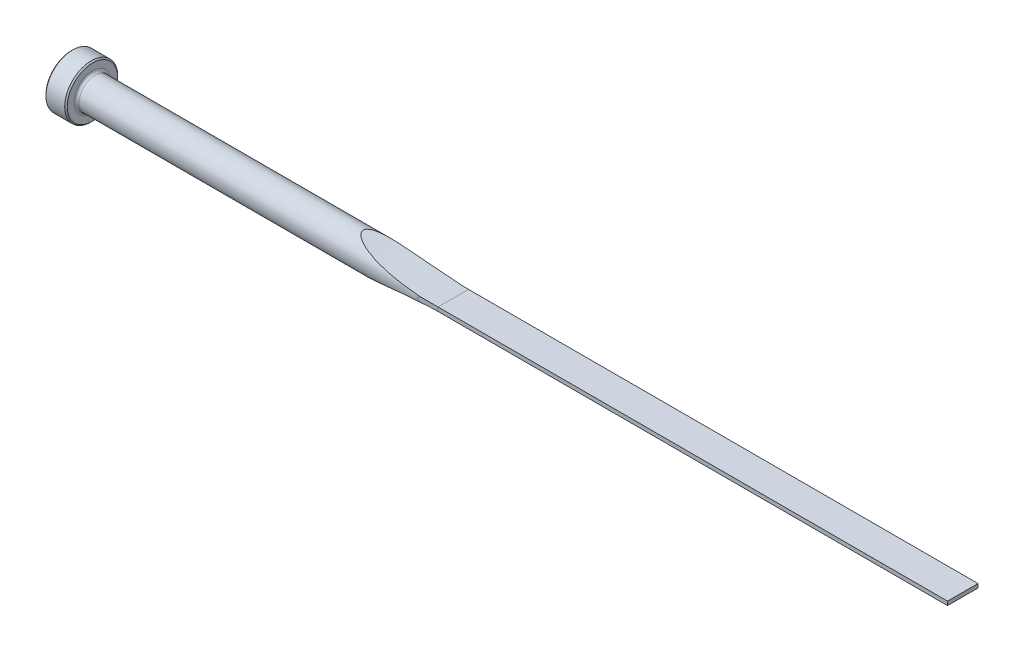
ISO-10303-21;
HEADER;
FILE_DESCRIPTION(('STEP AP214'),'2;1');
FILE_NAME('part.step','',(''),(''),'','','');
FILE_SCHEMA(('AUTOMOTIVE_DESIGN { 1 0 10303 214 1 1 1 1 }'));
ENDSEC;
DATA;
#1=APPLICATION_CONTEXT('core data for automotive mechanical design processes');
#2=APPLICATION_PROTOCOL_DEFINITION('international standard','automotive_design',2000,#1);
#3=PRODUCT_CONTEXT('',#1,'mechanical');
#4=PRODUCT('Part','Part','',(#3));
#5=PRODUCT_RELATED_PRODUCT_CATEGORY('part','',(#4));
#6=PRODUCT_DEFINITION_FORMATION('','',#4);
#7=PRODUCT_DEFINITION_CONTEXT('part definition',#1,'design');
#8=PRODUCT_DEFINITION('design','',#6,#7);
#9=PRODUCT_DEFINITION_SHAPE('','',#8);
#10=(LENGTH_UNIT() NAMED_UNIT(*) SI_UNIT(.MILLI.,.METRE.));
#11=(NAMED_UNIT(*) PLANE_ANGLE_UNIT() SI_UNIT($,.RADIAN.));
#12=(NAMED_UNIT(*) SI_UNIT($,.STERADIAN.) SOLID_ANGLE_UNIT());
#13=UNCERTAINTY_MEASURE_WITH_UNIT(LENGTH_MEASURE(1.E-05),#10,'distance_accuracy_value','');
#14=(GEOMETRIC_REPRESENTATION_CONTEXT(3) GLOBAL_UNCERTAINTY_ASSIGNED_CONTEXT((#13)) GLOBAL_UNIT_ASSIGNED_CONTEXT((#10,
#11,#12)) REPRESENTATION_CONTEXT('',''));
#15=CARTESIAN_POINT('',(0.,0.,0.));
#16=DIRECTION('',(0.,0.,1.));
#17=DIRECTION('',(1.,0.,0.));
#18=AXIS2_PLACEMENT_3D('',#15,#16,#17);
#19=CARTESIAN_POINT('',(0.,0.,0.));
#20=DIRECTION('',(-1.,0.,0.));
#21=DIRECTION('',(0.,0.,1.));
#22=AXIS2_PLACEMENT_3D('',#19,#20,#21);
#23=CYLINDRICAL_SURFACE('',#22,4.7625);
#24=CARTESIAN_POINT('',(7.112,0.,0.));
#25=DIRECTION('',(-1.,0.,0.));
#26=DIRECTION('',(0.,0.,1.));
#27=AXIS2_PLACEMENT_3D('',#24,#25,#26);
#28=CIRCLE('',#27,4.7625);
#29=CARTESIAN_POINT('',(7.112,0.,4.7625));
#30=VERTEX_POINT('',#29);
#31=EDGE_CURVE('E153',#30,#30,#28,.F.);
#32=ORIENTED_EDGE('',*,*,#31,.T.);
#33=EDGE_LOOP('',(#32));
#34=FACE_BOUND('',#33,.T.);
#35=CARTESIAN_POINT('',(114.3,1.37629566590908,4.55929999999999));
#36=CARTESIAN_POINT('',(114.100243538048,1.37627017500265,4.55929946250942));
#37=CARTESIAN_POINT('',(113.900483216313,1.37406392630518,4.55997325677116));
#38=CARTESIAN_POINT('',(113.501024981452,1.36511039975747,4.56266611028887));
#39=CARTESIAN_POINT('',(113.301327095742,1.35836200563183,4.56468550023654));
#40=CARTESIAN_POINT('',(112.900347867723,1.34006170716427,4.57009060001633));
#41=CARTESIAN_POINT('',(112.699068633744,1.32846669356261,4.57348856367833));
#42=CARTESIAN_POINT('',(112.296928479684,1.30007175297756,4.58164172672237));
#43=CARTESIAN_POINT('',(112.096067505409,1.28327254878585,4.58639673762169));
#44=CARTESIAN_POINT('',(111.696176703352,1.24395343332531,4.59721659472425));
#45=CARTESIAN_POINT('',(111.497143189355,1.22146913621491,4.60327325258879));
#46=CARTESIAN_POINT('',(111.099904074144,1.16973426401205,4.6166926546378));
#47=CARTESIAN_POINT('',(110.90169881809,1.1404811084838,4.62405589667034));
#48=CARTESIAN_POINT('',(110.507485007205,1.07370926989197,4.640013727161));
#49=CARTESIAN_POINT('',(110.311471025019,1.03622172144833,4.64860363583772));
#50=CARTESIAN_POINT('',(109.921964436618,0.950234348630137,4.66695416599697));
#51=CARTESIAN_POINT('',(109.728469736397,0.901744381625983,4.67671373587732));
#52=CARTESIAN_POINT('',(109.489568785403,0.830609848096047,4.68952997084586));
#53=CARTESIAN_POINT('',(109.441796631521,0.815810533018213,4.69213189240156));
#54=CARTESIAN_POINT('',(109.346645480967,0.784967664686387,4.69739068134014));
#55=CARTESIAN_POINT('',(109.29926657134,0.768923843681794,4.70004756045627));
#56=CARTESIAN_POINT('',(109.157175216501,0.71840494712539,4.70812874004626));
#57=CARTESIAN_POINT('',(109.063234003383,0.681752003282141,4.71362458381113));
#58=CARTESIAN_POINT('',(108.877534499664,0.599731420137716,4.72477713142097));
#59=CARTESIAN_POINT('',(108.785820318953,0.554256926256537,4.73043499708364));
#60=CARTESIAN_POINT('',(108.654614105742,0.476034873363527,4.73871868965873));
#61=CARTESIAN_POINT('',(108.612099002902,0.448424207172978,4.7414354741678));
#62=CARTESIAN_POINT('',(108.530424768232,0.388667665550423,4.74670987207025));
#63=CARTESIAN_POINT('',(108.491254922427,0.35653721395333,4.74926798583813));
#64=CARTESIAN_POINT('',(108.434384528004,0.301094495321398,4.75301502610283));
#65=CARTESIAN_POINT('',(108.414664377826,0.279884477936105,4.75432176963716));
#66=CARTESIAN_POINT('',(108.378171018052,0.235020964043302,4.75675058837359));
#67=CARTESIAN_POINT('',(108.361393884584,0.211370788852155,4.75787290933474));
#68=CARTESIAN_POINT('',(108.336135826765,0.16808537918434,4.75956809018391));
#69=CARTESIAN_POINT('',(108.326635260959,0.149056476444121,4.76020769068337));
#70=CARTESIAN_POINT('',(108.31078402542,0.109713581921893,4.76127659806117));
#71=CARTESIAN_POINT('',(108.304429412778,0.0894012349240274,4.76170616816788));
#72=CARTESIAN_POINT('',(108.295545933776,0.0476995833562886,4.76230708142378));
#73=CARTESIAN_POINT('',(108.293058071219,0.0263011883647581,4.76247565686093));
#74=CARTESIAN_POINT('',(108.292412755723,-0.0165581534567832,4.76251936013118));
#75=CARTESIAN_POINT('',(108.294253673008,-0.0380190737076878,4.76239459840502));
#76=CARTESIAN_POINT('',(108.30142234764,-0.0771509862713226,4.76190953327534));
#77=CARTESIAN_POINT('',(108.306214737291,-0.0949256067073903,4.76158540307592));
#78=CARTESIAN_POINT('',(108.318318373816,-0.129583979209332,4.76076832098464));
#79=CARTESIAN_POINT('',(108.325631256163,-0.146467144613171,4.76027525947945));
#80=CARTESIAN_POINT('',(108.347823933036,-0.190109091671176,4.75878258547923));
#81=CARTESIAN_POINT('',(108.364497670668,-0.21594512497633,4.75766444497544));
#82=CARTESIAN_POINT('',(108.401515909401,-0.264813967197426,4.75519504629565));
#83=CARTESIAN_POINT('',(108.421871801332,-0.287837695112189,4.75384306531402));
#84=CARTESIAN_POINT('',(108.486246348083,-0.353109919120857,4.74959319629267));
#85=CARTESIAN_POINT('',(108.5337556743,-0.391849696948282,4.74648889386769));
#86=CARTESIAN_POINT('',(108.633252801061,-0.462955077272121,4.74007706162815));
#87=CARTESIAN_POINT('',(108.685255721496,-0.495297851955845,4.73676885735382));
#88=CARTESIAN_POINT('',(108.832460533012,-0.57848482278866,4.72754240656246));
#89=CARTESIAN_POINT('',(108.930312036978,-0.624585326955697,4.72156110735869));
#90=CARTESIAN_POINT('',(109.129656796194,-0.708279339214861,4.70972175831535));
#91=CARTESIAN_POINT('',(109.231158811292,-0.745850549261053,4.70386406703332));
#92=CARTESIAN_POINT('',(109.437175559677,-0.815246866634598,4.69233729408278));
#93=CARTESIAN_POINT('',(109.54170965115,-0.847014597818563,4.68667050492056));
#94=CARTESIAN_POINT('',(109.751931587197,-0.905852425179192,4.67565197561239));
#95=CARTESIAN_POINT('',(109.857617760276,-0.93292855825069,4.67029983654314));
#96=CARTESIAN_POINT('',(110.147207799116,-1.00180171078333,4.65615804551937));
#97=CARTESIAN_POINT('',(110.331993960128,-1.03994988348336,4.64770520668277));
#98=CARTESIAN_POINT('',(110.703115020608,-1.10820041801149,4.63190013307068));
#99=CARTESIAN_POINT('',(110.889450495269,-1.13829964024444,4.62454832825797));
#100=CARTESIAN_POINT('',(111.263496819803,-1.19209136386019,4.61097562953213));
#101=CARTESIAN_POINT('',(111.451209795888,-1.21576959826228,4.60475726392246));
#102=CARTESIAN_POINT('',(111.827286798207,-1.25764094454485,4.5934961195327));
#103=CARTESIAN_POINT('',(112.015650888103,-1.27583350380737,4.58845345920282));
#104=CARTESIAN_POINT('',(112.553477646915,-1.32086317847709,4.5757714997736));
#105=CARTESIAN_POINT('',(112.903477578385,-1.34186157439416,4.56957976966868));
#106=CARTESIAN_POINT('',(113.428033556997,-1.36263417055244,4.56340533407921));
#107=CARTESIAN_POINT('',(113.602391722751,-1.3677712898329,4.56186604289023));
#108=CARTESIAN_POINT('',(113.951163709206,-1.37459791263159,4.55981341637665));
#109=CARTESIAN_POINT('',(114.125577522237,-1.37628777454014,4.55929997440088));
#110=CARTESIAN_POINT('',(114.3,-1.37629566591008,4.55929999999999));
#111=B_SPLINE_CURVE_WITH_KNOTS('',3,(#35,#36,#37,#38,#39,#40,#41,#42,#43,#44,#45,#46,#47,#48,
#49,#50,#51,#52,#53,#54,#55,#56,#57,#58,#59,#60,#61,#62,#63,#64,#65,#66,#67,#68,#69,#70,#71,#72,
#73,#74,#75,#76,#77,#78,#79,#80,#81,#82,#83,#84,#85,#86,#87,#88,#89,#90,#91,#92,#93,#94,#95,#96,
#97,#98,#99,#100,#101,#102,#103,#104,#105,#106,#107,#108,#109,#110),.UNSPECIFIED.,.F.,.F.,(4,2,
2,2,2,2,2,2,2,2,2,2,2,2,2,2,2,2,2,2,2,2,2,2,2,2,2,2,2,2,2,2,2,2,2,2,2,4),(0.,0.599262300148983,
1.19867192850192,1.80353056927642,2.40830524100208,3.00938132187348,3.61068692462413,
4.20975694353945,4.80829234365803,4.95851786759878,5.10877580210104,5.41155733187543,
5.71826557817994,5.87039269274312,6.02201272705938,6.10881533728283,6.19550132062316,
6.2591195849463,6.32265791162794,6.38686552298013,6.45104896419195,6.50606849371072,
6.56112379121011,6.65289509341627,6.74495530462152,6.92807013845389,7.11182707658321,
7.43597686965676,7.76096456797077,8.08900931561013,8.41662876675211,8.98296372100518,
9.54951926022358,10.117323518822,10.6851849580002,11.7368092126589,12.26010406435,
12.7833445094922),.UNSPECIFIED.);
#112=CARTESIAN_POINT('',(109.193722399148,0.730969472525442,4.70606947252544));
#113=VERTEX_POINT('',#112);
#114=CARTESIAN_POINT('',(109.193722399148,-0.730969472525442,4.70606947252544));
#115=VERTEX_POINT('',#114);
#116=EDGE_CURVE('E156',#113,#115,#111,.T.);
#117=ORIENTED_EDGE('',*,*,#116,.F.);
#118=CARTESIAN_POINT('',(114.3,0.584199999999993,4.72653325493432));
#119=CARTESIAN_POINT('',(113.902944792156,0.584199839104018,4.72652364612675));
#120=CARTESIAN_POINT('',(113.505889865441,0.586860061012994,4.7262042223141));
#121=CARTESIAN_POINT('',(112.711851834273,0.597500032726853,4.72487593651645));
#122=CARTESIAN_POINT('',(112.314868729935,0.605479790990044,4.7238670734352));
#123=CARTESIAN_POINT('',(111.521014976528,0.626758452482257,4.72108998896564));
#124=CARTESIAN_POINT('',(111.124144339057,0.640057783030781,4.71932170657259));
#125=CARTESIAN_POINT('',(110.330625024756,0.671972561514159,4.71488209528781));
#126=CARTESIAN_POINT('',(109.933976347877,0.690588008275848,4.71221076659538));
#127=CARTESIAN_POINT('',(108.742109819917,0.754530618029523,4.70255315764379));
#128=CARTESIAN_POINT('',(107.947318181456,0.807891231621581,4.69392942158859));
#129=CARTESIAN_POINT('',(106.35960041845,0.935939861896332,4.67008030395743));
#130=CARTESIAN_POINT('',(105.56667420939,1.01062689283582,4.65485522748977));
#131=CARTESIAN_POINT('',(103.983027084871,1.1812867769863,4.61451041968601));
#132=CARTESIAN_POINT('',(103.192307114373,1.27726765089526,4.58938695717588));
#133=CARTESIAN_POINT('',(102.008766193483,1.4370868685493,4.5408421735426));
#134=CARTESIAN_POINT('',(101.614638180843,1.49300736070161,4.52284840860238));
#135=CARTESIAN_POINT('',(100.827389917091,1.61010184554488,4.48250212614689));
#136=CARTESIAN_POINT('',(100.434269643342,1.67127571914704,4.46014970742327));
#137=CARTESIAN_POINT('',(99.6495779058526,1.79877941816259,4.41026980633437));
#138=CARTESIAN_POINT('',(99.2580053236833,1.8651042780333,4.3827472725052));
#139=CARTESIAN_POINT('',(98.4762617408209,2.00290585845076,4.3215116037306));
#140=CARTESIAN_POINT('',(98.0860906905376,2.07438239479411,4.28779869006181));
#141=CARTESIAN_POINT('',(97.3075285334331,2.22239347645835,4.2129861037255));
#142=CARTESIAN_POINT('',(96.9191369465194,2.29892655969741,4.17188856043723));
#143=CARTESIAN_POINT('',(96.1444245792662,2.45695511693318,4.08082096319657));
#144=CARTESIAN_POINT('',(95.7581036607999,2.53845025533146,4.03085150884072));
#145=CARTESIAN_POINT('',(94.9874438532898,2.70637498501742,3.92008763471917));
#146=CARTESIAN_POINT('',(94.6031088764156,2.79281189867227,3.85927685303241));
#147=CARTESIAN_POINT('',(93.8377159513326,2.97027452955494,3.72442012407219));
#148=CARTESIAN_POINT('',(93.4566587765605,3.06130129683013,3.65037113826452));
#149=CARTESIAN_POINT('',(92.6987741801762,3.24761090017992,3.48568183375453));
#150=CARTESIAN_POINT('',(92.3219502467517,3.34289696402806,3.39502876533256));
#151=CARTESIAN_POINT('',(91.7618242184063,3.4883984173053,3.24304672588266));
#152=CARTESIAN_POINT('',(91.5760042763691,3.53731746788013,3.18973138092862));
#153=CARTESIAN_POINT('',(91.2064522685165,3.63587680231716,3.07691915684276));
#154=CARTESIAN_POINT('',(91.0227199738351,3.68551700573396,3.01742296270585));
#155=CARTESIAN_POINT('',(90.6569945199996,3.78557453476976,2.89091152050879));
#156=CARTESIAN_POINT('',(90.4750141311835,3.83599446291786,2.82386117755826));
#157=CARTESIAN_POINT('',(90.114453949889,3.93711113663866,2.68108699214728));
#158=CARTESIAN_POINT('',(89.9358753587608,3.98780797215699,2.60536014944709));
#159=CARTESIAN_POINT('',(89.5841209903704,4.08883317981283,2.44374796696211));
#160=CARTESIAN_POINT('',(89.4109269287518,4.13916221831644,2.35790320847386));
#161=CARTESIAN_POINT('',(89.0712961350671,4.23894369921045,2.17342840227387));
#162=CARTESIAN_POINT('',(88.9048532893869,4.28839691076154,2.07481027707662));
#163=CARTESIAN_POINT('',(88.6275154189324,4.3716378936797,1.89136325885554));
#164=CARTESIAN_POINT('',(88.5141792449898,4.40591470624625,1.81047425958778));
#165=CARTESIAN_POINT('',(88.2946283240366,4.47276665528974,1.63838676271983));
#166=CARTESIAN_POINT('',(88.1884253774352,4.50533895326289,1.54717182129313));
#167=CARTESIAN_POINT('',(87.9857286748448,4.5678854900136,1.35148733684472));
#168=CARTESIAN_POINT('',(87.8893444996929,4.59782997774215,1.24689256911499));
#169=CARTESIAN_POINT('',(87.7135348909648,4.65273004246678,1.02307765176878));
#170=CARTESIAN_POINT('',(87.6340566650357,4.6777011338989,0.903904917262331));
#171=CARTESIAN_POINT('',(87.5263611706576,4.71165622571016,0.69859144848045));
#172=CARTESIAN_POINT('',(87.4901398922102,4.72310998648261,0.617097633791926));
#173=CARTESIAN_POINT('',(87.4304074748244,4.74202643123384,0.449118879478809));
#174=CARTESIAN_POINT('',(87.4068809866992,4.74949393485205,0.362640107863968));
#175=CARTESIAN_POINT('',(87.3747493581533,4.75969832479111,0.185892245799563));
#176=CARTESIAN_POINT('',(87.3662630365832,4.7623975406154,0.0955986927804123));
#177=CARTESIAN_POINT('',(87.3656367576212,4.76259662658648,-0.085057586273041));
#178=CARTESIAN_POINT('',(87.3734964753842,4.76009660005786,-0.175420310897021));
#179=CARTESIAN_POINT('',(87.4031382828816,4.75068226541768,-0.344936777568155));
#180=CARTESIAN_POINT('',(87.4235784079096,4.74419351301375,-0.424358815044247));
#181=CARTESIAN_POINT('',(87.4753356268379,4.72779541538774,-0.579160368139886));
#182=CARTESIAN_POINT('',(87.5066584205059,4.71788427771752,-0.654537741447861));
#183=CARTESIAN_POINT('',(87.5996380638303,4.68853838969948,-0.844402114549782));
#184=CARTESIAN_POINT('',(87.6682094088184,4.66696066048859,-0.955150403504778));
#185=CARTESIAN_POINT('',(87.8207367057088,4.61921883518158,-1.16440044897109));
#186=CARTESIAN_POINT('',(87.9047403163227,4.59304054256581,-1.26286263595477));
#187=CARTESIAN_POINT('',(88.0765502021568,4.53981707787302,-1.44205709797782));
#188=CARTESIAN_POINT('',(88.1636312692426,4.51297467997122,-1.52355894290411));
#189=CARTESIAN_POINT('',(88.3442071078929,4.45764093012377,-1.67857793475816));
#190=CARTESIAN_POINT('',(88.4377077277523,4.42914807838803,-1.75208763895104));
#191=CARTESIAN_POINT('',(88.6295566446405,4.37104937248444,-1.89238074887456));
#192=CARTESIAN_POINT('',(88.7279143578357,4.34144138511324,-1.95915025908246));
#193=CARTESIAN_POINT('',(88.9281237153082,4.28156612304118,-2.08675712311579));
#194=CARTESIAN_POINT('',(89.0299740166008,4.25129910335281,-2.14759672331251));
#195=CARTESIAN_POINT('',(89.2910069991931,4.17425155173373,-2.29503203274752));
#196=CARTESIAN_POINT('',(89.4520244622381,4.12720291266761,-2.37823331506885));
#197=CARTESIAN_POINT('',(89.7786309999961,4.03280203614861,-2.53500840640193));
#198=CARTESIAN_POINT('',(89.9442223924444,3.98544965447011,-2.60857722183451));
#199=CARTESIAN_POINT('',(90.2790520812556,3.89077510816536,-2.74779361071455));
#200=CARTESIAN_POINT('',(90.4482962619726,3.84345314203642,-2.81342707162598));
#201=CARTESIAN_POINT('',(90.7893834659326,3.74918830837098,-2.93787024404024));
#202=CARTESIAN_POINT('',(90.9612267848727,3.70224548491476,-2.99667917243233));
#203=CARTESIAN_POINT('',(91.3078505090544,3.6086886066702,-3.10871744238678));
#204=CARTESIAN_POINT('',(91.4826415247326,3.56207751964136,-3.16191626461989));
#205=CARTESIAN_POINT('',(91.8338956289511,3.4695666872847,-3.263159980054));
#206=CARTESIAN_POINT('',(92.0103587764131,3.42366696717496,-3.31120469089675));
#207=CARTESIAN_POINT('',(92.3644516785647,3.33273400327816,-3.4027115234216));
#208=CARTESIAN_POINT('',(92.5420798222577,3.28769980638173,-3.44617895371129));
#209=CARTESIAN_POINT('',(92.8984831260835,3.19851852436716,-3.52910575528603));
#210=CARTESIAN_POINT('',(93.0772582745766,3.15437143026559,-3.56856516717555));
#211=CARTESIAN_POINT('',(93.5883189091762,3.02986034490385,-3.67597342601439));
#212=CARTESIAN_POINT('',(93.921796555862,2.950640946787,-3.73959639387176));
#213=CARTESIAN_POINT('',(94.5913367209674,2.79569603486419,-3.85679987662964));
#214=CARTESIAN_POINT('',(94.9273995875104,2.71997100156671,-3.91037901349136));
#215=CARTESIAN_POINT('',(95.6017052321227,2.57215848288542,-4.0091532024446));
#216=CARTESIAN_POINT('',(95.9399489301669,2.50007266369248,-4.05434443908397));
#217=CARTESIAN_POINT('',(96.6181027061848,2.3596889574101,-4.13762369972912));
#218=CARTESIAN_POINT('',(96.9580128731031,2.29139127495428,-4.17571134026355));
#219=CARTESIAN_POINT('',(97.6399513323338,2.15852385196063,-4.24592035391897));
#220=CARTESIAN_POINT('',(97.9819826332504,2.09396260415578,-4.27802847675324));
#221=CARTESIAN_POINT('',(98.6672169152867,1.96878754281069,-4.3370563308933));
#222=CARTESIAN_POINT('',(99.0104199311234,1.90817384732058,-4.36397590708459));
#223=CARTESIAN_POINT('',(100.041334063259,1.73235474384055,-4.43808621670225));
#224=CARTESIAN_POINT('',(100.73055311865,1.62313178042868,-4.47864845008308));
#225=CARTESIAN_POINT('',(102.111762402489,1.42090467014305,-4.54684140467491));
#226=CARTESIAN_POINT('',(102.803751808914,1.32789603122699,-4.57447571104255));
#227=CARTESIAN_POINT('',(104.190073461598,1.15817280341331,-4.62036451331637));
#228=CARTESIAN_POINT('',(104.884405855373,1.08145926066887,-4.63861840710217));
#229=CARTESIAN_POINT('',(106.274034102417,0.944486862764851,-4.66843092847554));
#230=CARTESIAN_POINT('',(106.969327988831,0.884209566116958,-4.67999707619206));
#231=CARTESIAN_POINT('',(108.361166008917,0.780044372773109,-4.69848274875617));
#232=CARTESIAN_POINT('',(109.057710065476,0.736155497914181,-4.70540255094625));
#233=CARTESIAN_POINT('',(110.13356868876,0.681076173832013,-4.71358774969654));
#234=CARTESIAN_POINT('',(110.512588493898,0.664103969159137,-4.71599244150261));
#235=CARTESIAN_POINT('',(111.270851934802,0.635011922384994,-4.71999838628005));
#236=CARTESIAN_POINT('',(111.650095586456,0.62289248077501,-4.72159957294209));
#237=CARTESIAN_POINT('',(112.407767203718,0.603534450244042,-4.72411384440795));
#238=CARTESIAN_POINT('',(112.786194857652,0.596283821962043,-4.72502862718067));
#239=CARTESIAN_POINT('',(113.543081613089,0.586616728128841,-4.72623431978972));
#240=CARTESIAN_POINT('',(113.921540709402,0.584199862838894,-4.72652528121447));
#241=CARTESIAN_POINT('',(114.3,0.584199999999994,-4.72653325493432));
#242=B_SPLINE_CURVE_WITH_KNOTS('',3,(#118,#119,#120,#121,#122,#123,#124,#125,#126,#127,#128,
#129,#130,#131,#132,#133,#134,#135,#136,#137,#138,#139,#140,#141,#142,#143,#144,#145,#146,#147,
#148,#149,#150,#151,#152,#153,#154,#155,#156,#157,#158,#159,#160,#161,#162,#163,#164,#165,#166,
#167,#168,#169,#170,#171,#172,#173,#174,#175,#176,#177,#178,#179,#180,#181,#182,#183,#184,#185,
#186,#187,#188,#189,#190,#191,#192,#193,#194,#195,#196,#197,#198,#199,#200,#201,#202,#203,#204,
#205,#206,#207,#208,#209,#210,#211,#212,#213,#214,#215,#216,#217,#218,#219,#220,#221,#222,#223,
#224,#225,#226,#227,#228,#229,#230,#231,#232,#233,#234,#235,#236,#237,#238,#239,#240,#241),
.UNSPECIFIED.,.F.,.F.,(4,2,2,2,2,2,2,2,2,2,2,2,2,2,2,2,2,2,2,2,2,2,2,2,2,2,2,2,2,2,2,2,2,2,2,2,
2,2,2,2,2,2,2,2,2,2,2,2,2,2,2,2,2,2,2,2,2,2,2,2,2,4),(0.,1.19115597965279,2.38231385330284,
3.57356743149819,4.76482074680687,7.15436772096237,9.54380426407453,11.9341423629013,
13.129539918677,14.3249103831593,15.5191424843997,16.7133319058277,17.907177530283,
19.1009425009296,20.2965246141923,21.4923814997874,22.6891605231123,23.2873079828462,
23.8853892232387,24.4863734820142,25.0875661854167,25.686424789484,26.2847284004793,
26.714511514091,27.1449889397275,27.5798390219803,28.013310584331,28.2821342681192,
28.5506321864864,28.8212419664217,29.0918463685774,29.3376505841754,29.5835837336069,
29.9774048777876,30.3724633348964,30.7386835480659,31.1052419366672,31.4725412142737,
31.8397008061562,32.4010306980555,32.9626504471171,33.5252547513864,34.0879235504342,
34.6535105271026,35.2191175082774,35.7840611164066,36.3489990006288,37.394609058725,
38.4403624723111,39.4865904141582,40.5328748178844,41.5814508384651,42.6300582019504,
44.7266503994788,46.8226608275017,48.9188057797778,51.0125890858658,53.1062474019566,
54.244442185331,55.382730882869,56.5181944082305,57.6535640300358),.UNSPECIFIED.);
#243=CARTESIAN_POINT('',(109.193722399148,0.730969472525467,-4.70606947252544));
#244=VERTEX_POINT('',#243);
#245=EDGE_CURVE('E106',#113,#244,#242,.T.);
#246=ORIENTED_EDGE('',*,*,#245,.T.);
#247=CARTESIAN_POINT('',(114.3,1.37629566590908,-4.55929999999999));
#248=CARTESIAN_POINT('',(114.100243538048,1.3762701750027,-4.5592994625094));
#249=CARTESIAN_POINT('',(113.900483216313,1.37406392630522,-4.55997325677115));
#250=CARTESIAN_POINT('',(113.501024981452,1.36511039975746,-4.56266611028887));
#251=CARTESIAN_POINT('',(113.301327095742,1.35836200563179,-4.56468550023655));
#252=CARTESIAN_POINT('',(112.900347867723,1.34006170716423,-4.57009060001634));
#253=CARTESIAN_POINT('',(112.699068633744,1.32846669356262,-4.57348856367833));
#254=CARTESIAN_POINT('',(112.296928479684,1.3000717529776,-4.58164172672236));
#255=CARTESIAN_POINT('',(112.096067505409,1.28327254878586,-4.58639673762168));
#256=CARTESIAN_POINT('',(111.696176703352,1.2439534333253,-4.59721659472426));
#257=CARTESIAN_POINT('',(111.497143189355,1.22146913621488,-4.6032732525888));
#258=CARTESIAN_POINT('',(111.099904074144,1.16973426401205,-4.61669265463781));
#259=CARTESIAN_POINT('',(110.90169881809,1.14048110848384,-4.62405589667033));
#260=CARTESIAN_POINT('',(110.507485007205,1.07370926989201,-4.64001372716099));
#261=CARTESIAN_POINT('',(110.311471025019,1.03622172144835,-4.64860363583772));
#262=CARTESIAN_POINT('',(109.921964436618,0.950234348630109,-4.66695416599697));
#263=CARTESIAN_POINT('',(109.728469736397,0.901744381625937,-4.67671373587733));
#264=CARTESIAN_POINT('',(109.489568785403,0.830609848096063,-4.68952997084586));
#265=CARTESIAN_POINT('',(109.441796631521,0.815810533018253,-4.69213189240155));
#266=CARTESIAN_POINT('',(109.346645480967,0.784967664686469,-4.69739068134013));
#267=CARTESIAN_POINT('',(109.29926657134,0.768923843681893,-4.70004756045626));
#268=CARTESIAN_POINT('',(109.157175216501,0.718404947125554,-4.70812874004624));
#269=CARTESIAN_POINT('',(109.063234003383,0.681752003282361,-4.7136245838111));
#270=CARTESIAN_POINT('',(108.877534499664,0.59973142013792,-4.72477713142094));
#271=CARTESIAN_POINT('',(108.785820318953,0.554256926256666,-4.73043499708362));
#272=CARTESIAN_POINT('',(108.654614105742,0.476034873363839,-4.7387186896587));
#273=CARTESIAN_POINT('',(108.612099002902,0.448424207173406,-4.74143547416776));
#274=CARTESIAN_POINT('',(108.530424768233,0.388667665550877,-4.74670987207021));
#275=CARTESIAN_POINT('',(108.491254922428,0.35653721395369,-4.7492679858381));
#276=CARTESIAN_POINT('',(108.434384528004,0.301094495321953,-4.7530150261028));
#277=CARTESIAN_POINT('',(108.414664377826,0.279884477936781,-4.75432176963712));
#278=CARTESIAN_POINT('',(108.378171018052,0.235020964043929,-4.75675058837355));
#279=CARTESIAN_POINT('',(108.361393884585,0.211370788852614,-4.75787290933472));
#280=CARTESIAN_POINT('',(108.336135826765,0.168085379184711,-4.7595680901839));
#281=CARTESIAN_POINT('',(108.326635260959,0.149056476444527,-4.76020769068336));
#282=CARTESIAN_POINT('',(108.31078402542,0.109713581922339,-4.76127659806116));
#283=CARTESIAN_POINT('',(108.304429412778,0.08940123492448,-4.76170616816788));
#284=CARTESIAN_POINT('',(108.295545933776,0.0476995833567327,-4.76230708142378));
#285=CARTESIAN_POINT('',(108.293058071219,0.0263011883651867,-4.76247565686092));
#286=CARTESIAN_POINT('',(108.292412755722,-0.0165581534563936,-4.76251936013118));
#287=CARTESIAN_POINT('',(108.294253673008,-0.0380190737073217,-4.76239459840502));
#288=CARTESIAN_POINT('',(108.30142234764,-0.0771509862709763,-4.76190953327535));
#289=CARTESIAN_POINT('',(108.306214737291,-0.0949256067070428,-4.76158540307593));
#290=CARTESIAN_POINT('',(108.318318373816,-0.129583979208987,-4.76076832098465));
#291=CARTESIAN_POINT('',(108.325631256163,-0.146467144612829,-4.76027525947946));
#292=CARTESIAN_POINT('',(108.347823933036,-0.190109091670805,-4.75878258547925));
#293=CARTESIAN_POINT('',(108.364497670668,-0.215945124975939,-4.75766444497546));
#294=CARTESIAN_POINT('',(108.4015159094,-0.264813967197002,-4.75519504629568));
#295=CARTESIAN_POINT('',(108.421871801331,-0.287837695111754,-4.75384306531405));
#296=CARTESIAN_POINT('',(108.486246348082,-0.353109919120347,-4.74959319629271));
#297=CARTESIAN_POINT('',(108.5337556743,-0.391849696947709,-4.74648889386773));
#298=CARTESIAN_POINT('',(108.63325280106,-0.462955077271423,-4.74007706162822));
#299=CARTESIAN_POINT('',(108.685255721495,-0.495297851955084,-4.7367688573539));
#300=CARTESIAN_POINT('',(108.832460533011,-0.57848482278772,-4.72754240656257));
#301=CARTESIAN_POINT('',(108.930312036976,-0.62458532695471,-4.72156110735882));
#302=CARTESIAN_POINT('',(109.129656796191,-0.708279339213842,-4.7097217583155));
#303=CARTESIAN_POINT('',(109.231158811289,-0.745850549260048,-4.70386406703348));
#304=CARTESIAN_POINT('',(109.437175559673,-0.815246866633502,-4.69233729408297));
#305=CARTESIAN_POINT('',(109.541709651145,-0.847014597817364,-4.68667050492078));
#306=CARTESIAN_POINT('',(109.751931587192,-0.905852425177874,-4.67565197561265));
#307=CARTESIAN_POINT('',(109.857617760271,-0.932928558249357,-4.6702998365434));
#308=CARTESIAN_POINT('',(110.147207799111,-1.00180171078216,-4.65615804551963));
#309=CARTESIAN_POINT('',(110.331993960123,-1.03994988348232,-4.647705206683));
#310=CARTESIAN_POINT('',(110.703115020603,-1.10820041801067,-4.63190013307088));
#311=CARTESIAN_POINT('',(110.889450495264,-1.13829964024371,-4.62454832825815));
#312=CARTESIAN_POINT('',(111.263496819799,-1.19209136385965,-4.61097562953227));
#313=CARTESIAN_POINT('',(111.451209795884,-1.21576959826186,-4.60475726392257));
#314=CARTESIAN_POINT('',(111.827286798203,-1.25764094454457,-4.59349611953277));
#315=CARTESIAN_POINT('',(112.015650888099,-1.27583350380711,-4.58845345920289));
#316=CARTESIAN_POINT('',(112.553477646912,-1.32086317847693,-4.57577149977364));
#317=CARTESIAN_POINT('',(112.903477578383,-1.3418615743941,-4.5695797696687));
#318=CARTESIAN_POINT('',(113.428033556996,-1.36263417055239,-4.56340533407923));
#319=CARTESIAN_POINT('',(113.602391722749,-1.36777128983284,-4.56186604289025));
#320=CARTESIAN_POINT('',(113.951163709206,-1.37459791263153,-4.55981341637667));
#321=CARTESIAN_POINT('',(114.125577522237,-1.3762877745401,-4.55929997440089));
#322=CARTESIAN_POINT('',(114.3,-1.3762956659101,-4.55929999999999));
#323=B_SPLINE_CURVE_WITH_KNOTS('',3,(#247,#248,#249,#250,#251,#252,#253,#254,#255,#256,#257,
#258,#259,#260,#261,#262,#263,#264,#265,#266,#267,#268,#269,#270,#271,#272,#273,#274,#275,#276,
#277,#278,#279,#280,#281,#282,#283,#284,#285,#286,#287,#288,#289,#290,#291,#292,#293,#294,#295,
#296,#297,#298,#299,#300,#301,#302,#303,#304,#305,#306,#307,#308,#309,#310,#311,#312,#313,#314,
#315,#316,#317,#318,#319,#320,#321,#322),.UNSPECIFIED.,.F.,.F.,(4,2,2,2,2,2,2,2,2,2,2,2,2,2,2,2,
2,2,2,2,2,2,2,2,2,2,2,2,2,2,2,2,2,2,2,2,2,4),(0.,0.599262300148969,1.1986719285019,
1.80353056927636,2.40830524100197,3.0093813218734,3.61068692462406,4.20975694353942,
4.80829234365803,4.9585178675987,5.10877580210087,5.41155733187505,5.71826557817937,
5.87039269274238,6.02201272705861,6.10881533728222,6.19550132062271,6.2591195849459,
6.32265791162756,6.3868655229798,6.45104896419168,6.50606849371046,6.56112379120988,
6.65289509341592,6.74495530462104,6.92807013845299,7.11182707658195,7.43597686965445,
7.7609645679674,8.08900931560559,8.41662876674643,8.98296372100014,9.5495192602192,
10.1173235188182,10.6851849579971,11.7368092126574,12.2601040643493,12.7833445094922),.UNSPECIFIED.);
#324=CARTESIAN_POINT('',(109.193722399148,-0.730969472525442,-4.70606947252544));
#325=VERTEX_POINT('',#324);
#326=EDGE_CURVE('E175',#244,#325,#323,.T.);
#327=ORIENTED_EDGE('',*,*,#326,.T.);
#328=CARTESIAN_POINT('',(114.3,-0.584199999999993,4.72653325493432));
#329=CARTESIAN_POINT('',(113.902944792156,-0.584199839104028,4.72652364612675));
#330=CARTESIAN_POINT('',(113.505889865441,-0.586860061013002,4.7262042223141));
#331=CARTESIAN_POINT('',(112.711851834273,-0.597500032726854,4.72487593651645));
#332=CARTESIAN_POINT('',(112.314868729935,-0.605479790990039,4.7238670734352));
#333=CARTESIAN_POINT('',(111.521014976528,-0.626758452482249,4.72108998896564));
#334=CARTESIAN_POINT('',(111.124144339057,-0.640057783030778,4.71932170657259));
#335=CARTESIAN_POINT('',(110.330625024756,-0.671972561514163,4.71488209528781));
#336=CARTESIAN_POINT('',(109.933976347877,-0.690588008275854,4.71221076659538));
#337=CARTESIAN_POINT('',(108.742109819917,-0.754530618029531,4.70255315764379));
#338=CARTESIAN_POINT('',(107.947318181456,-0.807891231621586,4.69392942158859));
#339=CARTESIAN_POINT('',(106.35960041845,-0.935939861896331,4.67008030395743));
#340=CARTESIAN_POINT('',(105.56667420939,-1.01062689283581,4.65485522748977));
#341=CARTESIAN_POINT('',(103.983027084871,-1.1812867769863,4.61451041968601));
#342=CARTESIAN_POINT('',(103.192307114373,-1.27726765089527,4.58938695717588));
#343=CARTESIAN_POINT('',(102.008766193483,-1.43708686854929,4.54084217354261));
#344=CARTESIAN_POINT('',(101.614638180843,-1.4930073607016,4.52284840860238));
#345=CARTESIAN_POINT('',(100.827389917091,-1.61010184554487,4.48250212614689));
#346=CARTESIAN_POINT('',(100.434269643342,-1.67127571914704,4.46014970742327));
#347=CARTESIAN_POINT('',(99.6495779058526,-1.79877941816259,4.41026980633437));
#348=CARTESIAN_POINT('',(99.2580053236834,-1.86510427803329,4.38274727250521));
#349=CARTESIAN_POINT('',(98.4762617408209,-2.00290585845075,4.3215116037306));
#350=CARTESIAN_POINT('',(98.0860906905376,-2.07438239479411,4.2877986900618));
#351=CARTESIAN_POINT('',(97.3075285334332,-2.22239347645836,4.2129861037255));
#352=CARTESIAN_POINT('',(96.9191369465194,-2.29892655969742,4.17188856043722));
#353=CARTESIAN_POINT('',(96.1444245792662,-2.45695511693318,4.08082096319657));
#354=CARTESIAN_POINT('',(95.7581036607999,-2.53845025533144,4.03085150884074));
#355=CARTESIAN_POINT('',(94.9874438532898,-2.7063749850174,3.92008763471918));
#356=CARTESIAN_POINT('',(94.6031088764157,-2.79281189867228,3.8592768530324));
#357=CARTESIAN_POINT('',(93.8377159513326,-2.97027452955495,3.72442012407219));
#358=CARTESIAN_POINT('',(93.4566587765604,-3.06130129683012,3.65037113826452));
#359=CARTESIAN_POINT('',(92.6987741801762,-3.2476109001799,3.48568183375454));
#360=CARTESIAN_POINT('',(92.3219502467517,-3.34289696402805,3.39502876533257));
#361=CARTESIAN_POINT('',(91.7618242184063,-3.48839841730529,3.24304672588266));
#362=CARTESIAN_POINT('',(91.5760042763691,-3.53731746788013,3.18973138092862));
#363=CARTESIAN_POINT('',(91.2064522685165,-3.63587680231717,3.07691915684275));
#364=CARTESIAN_POINT('',(91.0227199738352,-3.68551700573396,3.01742296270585));
#365=CARTESIAN_POINT('',(90.6569945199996,-3.78557453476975,2.89091152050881));
#366=CARTESIAN_POINT('',(90.4750141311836,-3.83599446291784,2.82386117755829));
#367=CARTESIAN_POINT('',(90.114453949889,-3.93711113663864,2.68108699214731));
#368=CARTESIAN_POINT('',(89.9358753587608,-3.98780797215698,2.60536014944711));
#369=CARTESIAN_POINT('',(89.5841209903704,-4.08883317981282,2.44374796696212));
#370=CARTESIAN_POINT('',(89.4109269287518,-4.13916221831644,2.35790320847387));
#371=CARTESIAN_POINT('',(89.0712961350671,-4.23894369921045,2.17342840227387));
#372=CARTESIAN_POINT('',(88.904853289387,-4.28839691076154,2.07481027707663));
#373=CARTESIAN_POINT('',(88.6275154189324,-4.3716378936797,1.89136325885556));
#374=CARTESIAN_POINT('',(88.5141792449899,-4.40591470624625,1.8104742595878));
#375=CARTESIAN_POINT('',(88.2946283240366,-4.47276665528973,1.63838676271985));
#376=CARTESIAN_POINT('',(88.1884253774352,-4.50533895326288,1.54717182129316));
#377=CARTESIAN_POINT('',(87.9857286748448,-4.56788549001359,1.35148733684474));
#378=CARTESIAN_POINT('',(87.8893444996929,-4.59782997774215,1.24689256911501));
#379=CARTESIAN_POINT('',(87.7135348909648,-4.65273004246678,1.02307765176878));
#380=CARTESIAN_POINT('',(87.6340566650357,-4.67770113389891,0.903904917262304));
#381=CARTESIAN_POINT('',(87.5263611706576,-4.71165622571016,0.698591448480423));
#382=CARTESIAN_POINT('',(87.4901398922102,-4.72310998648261,0.61709763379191));
#383=CARTESIAN_POINT('',(87.4304074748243,-4.74202643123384,0.449118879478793));
#384=CARTESIAN_POINT('',(87.4068809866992,-4.74949393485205,0.362640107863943));
#385=CARTESIAN_POINT('',(87.3747493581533,-4.75969832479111,0.185892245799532));
#386=CARTESIAN_POINT('',(87.3662630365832,-4.7623975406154,0.0955986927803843));
#387=CARTESIAN_POINT('',(87.3656367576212,-4.76259662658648,-0.0850575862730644));
#388=CARTESIAN_POINT('',(87.3734964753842,-4.76009660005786,-0.175420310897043));
#389=CARTESIAN_POINT('',(87.4031382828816,-4.75068226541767,-0.344936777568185));
#390=CARTESIAN_POINT('',(87.4235784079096,-4.74419351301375,-0.424358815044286));
#391=CARTESIAN_POINT('',(87.4753356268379,-4.72779541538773,-0.579160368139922));
#392=CARTESIAN_POINT('',(87.5066584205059,-4.71788427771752,-0.654537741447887));
#393=CARTESIAN_POINT('',(87.5996380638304,-4.68853838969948,-0.844402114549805));
#394=CARTESIAN_POINT('',(87.6682094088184,-4.66696066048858,-0.955150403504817));
#395=CARTESIAN_POINT('',(87.8207367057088,-4.61921883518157,-1.16440044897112));
#396=CARTESIAN_POINT('',(87.9047403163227,-4.59304054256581,-1.26286263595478));
#397=CARTESIAN_POINT('',(88.0765502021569,-4.53981707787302,-1.44205709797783));
#398=CARTESIAN_POINT('',(88.1636312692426,-4.5129746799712,-1.52355894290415));
#399=CARTESIAN_POINT('',(88.344207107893,-4.45764093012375,-1.6785779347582));
#400=CARTESIAN_POINT('',(88.4377077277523,-4.42914807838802,-1.75208763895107));
#401=CARTESIAN_POINT('',(88.6295566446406,-4.37104937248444,-1.89238074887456));
#402=CARTESIAN_POINT('',(88.7279143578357,-4.34144138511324,-1.95915025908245));
#403=CARTESIAN_POINT('',(88.9281237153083,-4.28156612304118,-2.08675712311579));
#404=CARTESIAN_POINT('',(89.0299740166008,-4.2512991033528,-2.14759672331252));
#405=CARTESIAN_POINT('',(89.2910069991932,-4.17425155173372,-2.29503203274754));
#406=CARTESIAN_POINT('',(89.4520244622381,-4.12720291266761,-2.37823331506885));
#407=CARTESIAN_POINT('',(89.7786309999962,-4.03280203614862,-2.53500840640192));
#408=CARTESIAN_POINT('',(89.9442223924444,-3.98544965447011,-2.60857722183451));
#409=CARTESIAN_POINT('',(90.2790520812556,-3.89077510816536,-2.74779361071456));
#410=CARTESIAN_POINT('',(90.4482962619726,-3.84345314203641,-2.813427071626));
#411=CARTESIAN_POINT('',(90.7893834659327,-3.74918830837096,-2.93787024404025));
#412=CARTESIAN_POINT('',(90.9612267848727,-3.70224548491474,-2.99667917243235));
#413=CARTESIAN_POINT('',(91.3078505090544,-3.60868860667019,-3.10871744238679));
#414=CARTESIAN_POINT('',(91.4826415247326,-3.56207751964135,-3.1619162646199));
#415=CARTESIAN_POINT('',(91.8338956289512,-3.4695666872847,-3.263159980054));
#416=CARTESIAN_POINT('',(92.0103587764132,-3.42366696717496,-3.31120469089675));
#417=CARTESIAN_POINT('',(92.3644516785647,-3.33273400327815,-3.40271152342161));
#418=CARTESIAN_POINT('',(92.5420798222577,-3.28769980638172,-3.4461789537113));
#419=CARTESIAN_POINT('',(92.8984831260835,-3.19851852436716,-3.52910575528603));
#420=CARTESIAN_POINT('',(93.0772582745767,-3.15437143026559,-3.56856516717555));
#421=CARTESIAN_POINT('',(93.5883189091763,-3.02986034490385,-3.67597342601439));
#422=CARTESIAN_POINT('',(93.9217965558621,-2.95064094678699,-3.73959639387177));
#423=CARTESIAN_POINT('',(94.5913367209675,-2.79569603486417,-3.85679987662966));
#424=CARTESIAN_POINT('',(94.9273995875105,-2.7199710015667,-3.91037901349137));
#425=CARTESIAN_POINT('',(95.6017052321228,-2.57215848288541,-4.0091532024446));
#426=CARTESIAN_POINT('',(95.939948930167,-2.50007266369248,-4.05434443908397));
#427=CARTESIAN_POINT('',(96.6181027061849,-2.35968895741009,-4.13762369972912));
#428=CARTESIAN_POINT('',(96.9580128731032,-2.29139127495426,-4.17571134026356));
#429=CARTESIAN_POINT('',(97.6399513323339,-2.1585238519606,-4.24592035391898));
#430=CARTESIAN_POINT('',(97.9819826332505,-2.09396260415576,-4.27802847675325));
#431=CARTESIAN_POINT('',(98.6672169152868,-1.96878754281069,-4.3370563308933));
#432=CARTESIAN_POINT('',(99.0104199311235,-1.90817384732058,-4.36397590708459));
#433=CARTESIAN_POINT('',(100.041334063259,-1.73235474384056,-4.43808621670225));
#434=CARTESIAN_POINT('',(100.73055311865,-1.62313178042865,-4.47864845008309));
#435=CARTESIAN_POINT('',(102.111762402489,-1.42090467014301,-4.54684140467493));
#436=CARTESIAN_POINT('',(102.803751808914,-1.32789603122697,-4.57447571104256));
#437=CARTESIAN_POINT('',(104.190073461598,-1.15817280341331,-4.62036451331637));
#438=CARTESIAN_POINT('',(104.884405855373,-1.08145926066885,-4.63861840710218));
#439=CARTESIAN_POINT('',(106.274034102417,-0.94448686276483,-4.66843092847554));
#440=CARTESIAN_POINT('',(106.969327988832,-0.884209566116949,-4.67999707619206));
#441=CARTESIAN_POINT('',(108.361166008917,-0.780044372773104,-4.69848274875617));
#442=CARTESIAN_POINT('',(109.057710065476,-0.736155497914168,-4.70540255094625));
#443=CARTESIAN_POINT('',(110.13356868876,-0.681076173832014,-4.71358774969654));
#444=CARTESIAN_POINT('',(110.512588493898,-0.664103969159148,-4.71599244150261));
#445=CARTESIAN_POINT('',(111.270851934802,-0.635011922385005,-4.71999838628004));
#446=CARTESIAN_POINT('',(111.650095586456,-0.622892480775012,-4.72159957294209));
#447=CARTESIAN_POINT('',(112.407767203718,-0.603534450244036,-4.72411384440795));
#448=CARTESIAN_POINT('',(112.786194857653,-0.596283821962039,-4.72502862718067));
#449=CARTESIAN_POINT('',(113.543081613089,-0.586616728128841,-4.72623431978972));
#450=CARTESIAN_POINT('',(113.921540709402,-0.584199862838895,-4.72652528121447));
#451=CARTESIAN_POINT('',(114.3,-0.584199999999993,-4.72653325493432));
#452=B_SPLINE_CURVE_WITH_KNOTS('',3,(#328,#329,#330,#331,#332,#333,#334,#335,#336,#337,#338,
#339,#340,#341,#342,#343,#344,#345,#346,#347,#348,#349,#350,#351,#352,#353,#354,#355,#356,#357,
#358,#359,#360,#361,#362,#363,#364,#365,#366,#367,#368,#369,#370,#371,#372,#373,#374,#375,#376,
#377,#378,#379,#380,#381,#382,#383,#384,#385,#386,#387,#388,#389,#390,#391,#392,#393,#394,#395,
#396,#397,#398,#399,#400,#401,#402,#403,#404,#405,#406,#407,#408,#409,#410,#411,#412,#413,#414,
#415,#416,#417,#418,#419,#420,#421,#422,#423,#424,#425,#426,#427,#428,#429,#430,#431,#432,#433,
#434,#435,#436,#437,#438,#439,#440,#441,#442,#443,#444,#445,#446,#447,#448,#449,#450,#451),
.UNSPECIFIED.,.F.,.F.,(4,2,2,2,2,2,2,2,2,2,2,2,2,2,2,2,2,2,2,2,2,2,2,2,2,2,2,2,2,2,2,2,2,2,2,2,
2,2,2,2,2,2,2,2,2,2,2,2,2,2,2,2,2,2,2,2,2,2,2,2,2,4),(0.,1.1911559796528,2.38231385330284,
3.5735674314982,4.76482074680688,7.15436772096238,9.54380426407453,11.9341423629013,
13.129539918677,14.3249103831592,15.5191424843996,16.7133319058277,17.907177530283,
19.1009425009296,20.2965246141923,21.4923814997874,22.6891605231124,23.2873079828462,
23.8853892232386,24.4863734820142,25.0875661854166,25.686424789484,26.2847284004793,
26.714511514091,27.1449889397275,27.5798390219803,28.013310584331,28.2821342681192,
28.5506321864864,28.8212419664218,29.0918463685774,29.3376505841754,29.583583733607,
29.9774048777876,30.3724633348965,30.738683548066,31.1052419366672,31.4725412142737,
31.8397008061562,32.4010306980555,32.9626504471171,33.5252547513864,34.0879235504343,
34.6535105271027,35.2191175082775,35.7840611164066,36.3489990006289,37.3946090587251,
38.4403624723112,39.4865904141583,40.5328748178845,41.5814508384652,42.6300582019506,
44.7266503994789,46.8226608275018,48.918805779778,51.012589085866,53.1062474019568,
54.2444421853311,55.3827308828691,56.5181944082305,57.6535640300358),.UNSPECIFIED.);
#453=EDGE_CURVE('E105',#115,#325,#452,.T.);
#454=ORIENTED_EDGE('',*,*,#453,.F.);
#455=EDGE_LOOP('',(#117,#246,#327,#454));
#456=FACE_BOUND('',#455,.T.);
#457=ADVANCED_FACE('F33',(#34,#456),#23,.T.);
#458=CARTESIAN_POINT('',(266.7,4.7625,0.));
#459=DIRECTION('',(-1.,0.,0.));
#460=DIRECTION('',(0.,0.,1.));
#461=AXIS2_PLACEMENT_3D('',#458,#459,#460);
#462=PLANE('',#461);
#463=DIRECTION('',(0.,1.,0.));
#464=VECTOR('',#463,1.);
#465=CARTESIAN_POINT('',(266.7,-7.9375,4.55930000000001));
#466=LINE('',#465,#464);
#467=CARTESIAN_POINT('',(266.7,-0.584200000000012,4.55930000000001));
#468=VERTEX_POINT('',#467);
#469=CARTESIAN_POINT('',(266.7,0.584200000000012,4.55930000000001));
#470=VERTEX_POINT('',#469);
#471=EDGE_CURVE('E87',#468,#470,#466,.T.);
#472=ORIENTED_EDGE('',*,*,#471,.F.);
#473=DIRECTION('',(0.,0.,1.));
#474=VECTOR('',#473,1.);
#475=CARTESIAN_POINT('',(266.7,-0.584200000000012,0.));
#476=LINE('',#475,#474);
#477=CARTESIAN_POINT('',(266.7,-0.584200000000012,-4.5593));
#478=VERTEX_POINT('',#477);
#479=EDGE_CURVE('E100',#478,#468,#476,.T.);
#480=ORIENTED_EDGE('',*,*,#479,.F.);
#481=DIRECTION('',(0.,1.,0.));
#482=VECTOR('',#481,1.);
#483=CARTESIAN_POINT('',(266.7,-7.9375,-4.55930000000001));
#484=LINE('',#483,#482);
#485=CARTESIAN_POINT('',(266.7,0.584200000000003,-4.55930000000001));
#486=VERTEX_POINT('',#485);
#487=EDGE_CURVE('E56',#478,#486,#484,.T.);
#488=ORIENTED_EDGE('',*,*,#487,.T.);
#489=DIRECTION('',(0.,0.,1.));
#490=VECTOR('',#489,1.);
#491=CARTESIAN_POINT('',(266.7,0.584200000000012,0.));
#492=LINE('',#491,#490);
#493=EDGE_CURVE('E102',#486,#470,#492,.T.);
#494=ORIENTED_EDGE('',*,*,#493,.T.);
#495=EDGE_LOOP('',(#472,#480,#488,#494));
#496=FACE_BOUND('',#495,.T.);
#497=ADVANCED_FACE('F99',(#496),#462,.F.);
#498=CARTESIAN_POINT('',(114.3,89.4842,-7.9375));
#499=DIRECTION('',(0.,0.,1.));
#500=DIRECTION('',(1.,0.,0.));
#501=AXIS2_PLACEMENT_3D('',#498,#499,#500);
#502=CYLINDRICAL_SURFACE('',#501,88.9);
#503=CARTESIAN_POINT('',(114.3,89.4842,93.4593));
#504=DIRECTION('',(0.,-0.707106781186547,0.707106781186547));
#505=DIRECTION('',(0.,0.707106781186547,0.707106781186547));
#506=AXIS2_PLACEMENT_3D('',#503,#504,#505);
#507=ELLIPSE('',#506,125.723585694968,88.9);
#508=CARTESIAN_POINT('',(114.3,0.584200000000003,4.55929999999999));
#509=VERTEX_POINT('',#508);
#510=EDGE_CURVE('E162',#509,#113,#507,.F.);
#511=ORIENTED_EDGE('',*,*,#510,.F.);
#512=DIRECTION('',(0.,0.,1.));
#513=VECTOR('',#512,1.);
#514=CARTESIAN_POINT('',(114.3,0.584199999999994,-7.9375));
#515=LINE('',#514,#513);
#516=CARTESIAN_POINT('',(114.3,0.584200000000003,-4.55929999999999));
#517=VERTEX_POINT('',#516);
#518=EDGE_CURVE('E170',#517,#509,#515,.T.);
#519=ORIENTED_EDGE('',*,*,#518,.F.);
#520=CARTESIAN_POINT('',(114.3,89.4842,-93.4593));
#521=DIRECTION('',(0.,0.707106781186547,0.707106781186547));
#522=DIRECTION('',(0.,-0.707106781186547,0.707106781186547));
#523=AXIS2_PLACEMENT_3D('',#520,#521,#522);
#524=ELLIPSE('',#523,125.723585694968,88.9);
#525=EDGE_CURVE('E169',#517,#244,#524,.F.);
#526=ORIENTED_EDGE('',*,*,#525,.T.);
#527=ORIENTED_EDGE('',*,*,#245,.F.);
#528=EDGE_LOOP('',(#511,#519,#526,#527));
#529=FACE_BOUND('',#528,.T.);
#530=ADVANCED_FACE('F138',(#529),#502,.F.);
#531=CARTESIAN_POINT('',(266.7,0.584200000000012,-7.9375));
#532=DIRECTION('',(0.,-1.,0.));
#533=DIRECTION('',(1.,0.,0.));
#534=AXIS2_PLACEMENT_3D('',#531,#532,#533);
#535=PLANE('',#534);
#536=DIRECTION('',(-1.,0.,0.));
#537=VECTOR('',#536,1.);
#538=CARTESIAN_POINT('',(266.7,0.584200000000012,4.55930000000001));
#539=LINE('',#538,#537);
#540=EDGE_CURVE('E188',#470,#509,#539,.T.);
#541=ORIENTED_EDGE('',*,*,#540,.F.);
#542=ORIENTED_EDGE('',*,*,#493,.F.);
#543=DIRECTION('',(-1.,0.,0.));
#544=VECTOR('',#543,1.);
#545=CARTESIAN_POINT('',(266.7,0.584200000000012,-4.55930000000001));
#546=LINE('',#545,#544);
#547=EDGE_CURVE('E174',#486,#517,#546,.T.);
#548=ORIENTED_EDGE('',*,*,#547,.T.);
#549=ORIENTED_EDGE('',*,*,#518,.T.);
#550=EDGE_LOOP('',(#541,#542,#548,#549));
#551=FACE_BOUND('',#550,.T.);
#552=ADVANCED_FACE('F129',(#551),#535,.F.);
#553=CARTESIAN_POINT('',(114.3,-89.4842,-7.9375));
#554=DIRECTION('',(0.,0.,1.));
#555=DIRECTION('',(1.,0.,0.));
#556=AXIS2_PLACEMENT_3D('',#553,#554,#555);
#557=CYLINDRICAL_SURFACE('',#556,88.9);
#558=DIRECTION('',(0.,0.,1.));
#559=VECTOR('',#558,1.);
#560=CARTESIAN_POINT('',(114.3,-0.584199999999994,-7.9375));
#561=LINE('',#560,#559);
#562=CARTESIAN_POINT('',(114.3,-0.584200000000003,-4.55929999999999));
#563=VERTEX_POINT('',#562);
#564=CARTESIAN_POINT('',(114.3,-0.584199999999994,4.5593));
#565=VERTEX_POINT('',#564);
#566=EDGE_CURVE('E178',#563,#565,#561,.T.);
#567=ORIENTED_EDGE('',*,*,#566,.T.);
#568=CARTESIAN_POINT('',(114.3,-89.4842,93.4593));
#569=DIRECTION('',(0.,0.707106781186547,0.707106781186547));
#570=DIRECTION('',(0.,-0.707106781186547,0.707106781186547));
#571=AXIS2_PLACEMENT_3D('',#568,#569,#570);
#572=ELLIPSE('',#571,125.723585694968,88.9);
#573=EDGE_CURVE('E163',#565,#115,#572,.T.);
#574=ORIENTED_EDGE('',*,*,#573,.T.);
#575=ORIENTED_EDGE('',*,*,#453,.T.);
#576=CARTESIAN_POINT('',(114.3,-89.4842,-93.4593));
#577=DIRECTION('',(0.,-0.707106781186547,0.707106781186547));
#578=DIRECTION('',(0.,0.707106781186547,0.707106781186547));
#579=AXIS2_PLACEMENT_3D('',#576,#577,#578);
#580=ELLIPSE('',#579,125.723585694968,88.9);
#581=EDGE_CURVE('E180',#563,#325,#580,.T.);
#582=ORIENTED_EDGE('',*,*,#581,.F.);
#583=EDGE_LOOP('',(#567,#574,#575,#582));
#584=FACE_BOUND('',#583,.T.);
#585=ADVANCED_FACE('F124',(#584),#557,.F.);
#586=CARTESIAN_POINT('',(266.7,-0.584200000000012,-7.9375));
#587=DIRECTION('',(0.,-1.,0.));
#588=DIRECTION('',(1.,0.,0.));
#589=AXIS2_PLACEMENT_3D('',#586,#587,#588);
#590=PLANE('',#589);
#591=ORIENTED_EDGE('',*,*,#479,.T.);
#592=DIRECTION('',(-1.,0.,0.));
#593=VECTOR('',#592,1.);
#594=CARTESIAN_POINT('',(266.7,-0.584200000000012,4.55930000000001));
#595=LINE('',#594,#593);
#596=EDGE_CURVE('E84',#468,#565,#595,.T.);
#597=ORIENTED_EDGE('',*,*,#596,.T.);
#598=ORIENTED_EDGE('',*,*,#566,.F.);
#599=DIRECTION('',(-1.,0.,0.));
#600=VECTOR('',#599,1.);
#601=CARTESIAN_POINT('',(266.7,-0.584200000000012,-4.55930000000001));
#602=LINE('',#601,#600);
#603=EDGE_CURVE('E94',#478,#563,#602,.T.);
#604=ORIENTED_EDGE('',*,*,#603,.F.);
#605=EDGE_LOOP('',(#591,#597,#598,#604));
#606=FACE_BOUND('',#605,.T.);
#607=ADVANCED_FACE('F104',(#606),#590,.T.);
#608=CARTESIAN_POINT('',(0.,0.,0.));
#609=DIRECTION('',(1.,0.,0.));
#610=DIRECTION('',(0.,0.,-1.));
#611=AXIS2_PLACEMENT_3D('',#608,#609,#610);
#612=PLANE('',#611);
#613=CARTESIAN_POINT('',(0.,0.,0.));
#614=DIRECTION('',(1.,0.,0.));
#615=DIRECTION('',(0.,0.,-1.));
#616=AXIS2_PLACEMENT_3D('',#613,#614,#615);
#617=CIRCLE('',#616,7.55649999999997);
#618=CARTESIAN_POINT('',(0.,0.,-7.55649999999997));
#619=VERTEX_POINT('',#618);
#620=EDGE_CURVE('E239',#619,#619,#617,.F.);
#621=ORIENTED_EDGE('',*,*,#620,.T.);
#622=EDGE_LOOP('',(#621));
#623=FACE_BOUND('',#622,.T.);
#624=ADVANCED_FACE('F136',(#623),#612,.F.);
#625=CARTESIAN_POINT('',(0.,0.,0.));
#626=DIRECTION('',(-1.,0.,0.));
#627=DIRECTION('',(0.,0.,1.));
#628=AXIS2_PLACEMENT_3D('',#625,#626,#627);
#629=CYLINDRICAL_SURFACE('',#628,7.9375);
#630=CARTESIAN_POINT('',(0.381000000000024,0.,0.));
#631=DIRECTION('',(1.,0.,0.));
#632=DIRECTION('',(0.,0.,-1.));
#633=AXIS2_PLACEMENT_3D('',#630,#631,#632);
#634=CIRCLE('',#633,7.9375);
#635=CARTESIAN_POINT('',(0.381000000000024,0.,-7.9375));
#636=VERTEX_POINT('',#635);
#637=EDGE_CURVE('E41',#636,#636,#634,.T.);
#638=ORIENTED_EDGE('',*,*,#637,.T.);
#639=EDGE_LOOP('',(#638));
#640=FACE_BOUND('',#639,.T.);
#641=CARTESIAN_POINT('',(5.96900000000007,0.,0.));
#642=DIRECTION('',(-1.,0.,0.));
#643=DIRECTION('',(0.,0.,1.));
#644=AXIS2_PLACEMENT_3D('',#641,#642,#643);
#645=CIRCLE('',#644,7.9375);
#646=CARTESIAN_POINT('',(5.96900000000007,0.,7.9375));
#647=VERTEX_POINT('',#646);
#648=EDGE_CURVE('E240',#647,#647,#645,.T.);
#649=ORIENTED_EDGE('',*,*,#648,.T.);
#650=EDGE_LOOP('',(#649));
#651=FACE_BOUND('',#650,.T.);
#652=ADVANCED_FACE('F213',(#640,#651),#629,.T.);
#653=CARTESIAN_POINT('',(6.35,7.9375,0.));
#654=DIRECTION('',(-1.,0.,0.));
#655=DIRECTION('',(0.,0.,1.));
#656=AXIS2_PLACEMENT_3D('',#653,#654,#655);
#657=PLANE('',#656);
#658=CARTESIAN_POINT('',(6.35,0.,0.));
#659=DIRECTION('',(-1.,0.,0.));
#660=DIRECTION('',(0.,0.,1.));
#661=AXIS2_PLACEMENT_3D('',#658,#659,#660);
#662=CIRCLE('',#661,7.55650000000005);
#663=CARTESIAN_POINT('',(6.35,0.,7.55650000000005));
#664=VERTEX_POINT('',#663);
#665=EDGE_CURVE('E11',#664,#664,#662,.F.);
#666=ORIENTED_EDGE('',*,*,#665,.T.);
#667=EDGE_LOOP('',(#666));
#668=FACE_BOUND('',#667,.T.);
#669=CARTESIAN_POINT('',(6.35,0.,0.));
#670=DIRECTION('',(-1.,0.,0.));
#671=DIRECTION('',(0.,0.,1.));
#672=AXIS2_PLACEMENT_3D('',#669,#670,#671);
#673=CIRCLE('',#672,5.5245);
#674=CARTESIAN_POINT('',(6.35,0.,5.5245));
#675=VERTEX_POINT('',#674);
#676=EDGE_CURVE('E93',#675,#675,#673,.T.);
#677=ORIENTED_EDGE('',*,*,#676,.T.);
#678=EDGE_LOOP('',(#677));
#679=FACE_BOUND('',#678,.T.);
#680=ADVANCED_FACE('F208',(#668,#679),#657,.F.);
#681=CARTESIAN_POINT('',(266.7,-7.9375,-4.55930000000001));
#682=DIRECTION('',(0.,0.,1.));
#683=DIRECTION('',(1.,0.,0.));
#684=AXIS2_PLACEMENT_3D('',#681,#682,#683);
#685=PLANE('',#684);
#686=ORIENTED_EDGE('',*,*,#487,.F.);
#687=ORIENTED_EDGE('',*,*,#603,.T.);
#688=DIRECTION('',(0.,1.,0.));
#689=VECTOR('',#688,1.);
#690=CARTESIAN_POINT('',(114.3,-7.9375,-4.55929999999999));
#691=LINE('',#690,#689);
#692=EDGE_CURVE('E190',#563,#517,#691,.T.);
#693=ORIENTED_EDGE('',*,*,#692,.T.);
#694=ORIENTED_EDGE('',*,*,#547,.F.);
#695=EDGE_LOOP('',(#686,#687,#693,#694));
#696=FACE_BOUND('',#695,.T.);
#697=ADVANCED_FACE('F189',(#696),#685,.F.);
#698=CARTESIAN_POINT('',(114.3,-7.9375,-93.4593));
#699=DIRECTION('',(0.,1.,0.));
#700=DIRECTION('',(0.,0.,1.));
#701=AXIS2_PLACEMENT_3D('',#698,#699,#700);
#702=CYLINDRICAL_SURFACE('',#701,88.9);
#703=ORIENTED_EDGE('',*,*,#692,.F.);
#704=ORIENTED_EDGE('',*,*,#581,.T.);
#705=ORIENTED_EDGE('',*,*,#326,.F.);
#706=ORIENTED_EDGE('',*,*,#525,.F.);
#707=EDGE_LOOP('',(#703,#704,#705,#706));
#708=FACE_BOUND('',#707,.T.);
#709=ADVANCED_FACE('F131',(#708),#702,.F.);
#710=CARTESIAN_POINT('',(114.3,-7.9375,93.4593));
#711=DIRECTION('',(0.,1.,0.));
#712=DIRECTION('',(0.,0.,1.));
#713=AXIS2_PLACEMENT_3D('',#710,#711,#712);
#714=CYLINDRICAL_SURFACE('',#713,88.9);
#715=ORIENTED_EDGE('',*,*,#510,.T.);
#716=ORIENTED_EDGE('',*,*,#116,.T.);
#717=ORIENTED_EDGE('',*,*,#573,.F.);
#718=DIRECTION('',(0.,1.,0.));
#719=VECTOR('',#718,1.);
#720=CARTESIAN_POINT('',(114.3,-7.9375,4.55929999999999));
#721=LINE('',#720,#719);
#722=EDGE_CURVE('E48',#565,#509,#721,.T.);
#723=ORIENTED_EDGE('',*,*,#722,.T.);
#724=EDGE_LOOP('',(#715,#716,#717,#723));
#725=FACE_BOUND('',#724,.T.);
#726=ADVANCED_FACE('F201',(#725),#714,.F.);
#727=CARTESIAN_POINT('',(266.7,-7.9375,4.55930000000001));
#728=DIRECTION('',(0.,0.,1.));
#729=DIRECTION('',(1.,0.,0.));
#730=AXIS2_PLACEMENT_3D('',#727,#728,#729);
#731=PLANE('',#730);
#732=ORIENTED_EDGE('',*,*,#540,.T.);
#733=ORIENTED_EDGE('',*,*,#722,.F.);
#734=ORIENTED_EDGE('',*,*,#596,.F.);
#735=ORIENTED_EDGE('',*,*,#471,.T.);
#736=EDGE_LOOP('',(#732,#733,#734,#735));
#737=FACE_BOUND('',#736,.T.);
#738=ADVANCED_FACE('F86',(#737),#731,.T.);
#739=CARTESIAN_POINT('',(7.112,0.,0.));
#740=DIRECTION('',(-1.,0.,0.));
#741=DIRECTION('',(0.,0.,1.));
#742=AXIS2_PLACEMENT_3D('',#739,#740,#741);
#743=TOROIDAL_SURFACE('',#742,5.5245,0.762);
#744=ORIENTED_EDGE('',*,*,#31,.F.);
#745=EDGE_LOOP('',(#744));
#746=FACE_BOUND('',#745,.T.);
#747=ORIENTED_EDGE('',*,*,#676,.F.);
#748=EDGE_LOOP('',(#747));
#749=FACE_BOUND('',#748,.T.);
#750=ADVANCED_FACE('F206',(#746,#749),#743,.F.);
#751=CARTESIAN_POINT('',(0.,0.,0.));
#752=DIRECTION('',(1.,0.,0.));
#753=DIRECTION('',(0.,0.,-1.));
#754=AXIS2_PLACEMENT_3D('',#751,#752,#753);
#755=CONICAL_SURFACE('',#754,7.55649999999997,0.785398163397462);
#756=ORIENTED_EDGE('',*,*,#637,.F.);
#757=EDGE_LOOP('',(#756));
#758=FACE_BOUND('',#757,.T.);
#759=ORIENTED_EDGE('',*,*,#620,.F.);
#760=EDGE_LOOP('',(#759));
#761=FACE_BOUND('',#760,.T.);
#762=ADVANCED_FACE('F226',(#758,#761),#755,.T.);
#763=CARTESIAN_POINT('',(5.96900000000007,0.,0.));
#764=DIRECTION('',(-1.,0.,0.));
#765=DIRECTION('',(0.,0.,1.));
#766=AXIS2_PLACEMENT_3D('',#763,#764,#765);
#767=CONICAL_SURFACE('',#766,7.9375,0.785398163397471);
#768=ORIENTED_EDGE('',*,*,#665,.F.);
#769=EDGE_LOOP('',(#768));
#770=FACE_BOUND('',#769,.T.);
#771=ORIENTED_EDGE('',*,*,#648,.F.);
#772=EDGE_LOOP('',(#771));
#773=FACE_BOUND('',#772,.T.);
#774=ADVANCED_FACE('F35',(#770,#773),#767,.T.);
#775=CLOSED_SHELL('',(#457,#497,#530,#552,#585,#607,#624,#652,#680,#697,#709,#726,#738,#750,
#762,#774));
#776=MANIFOLD_SOLID_BREP('B2',#775);
#777=ADVANCED_BREP_SHAPE_REPRESENTATION('',(#18,#776),#14);
#778=SHAPE_DEFINITION_REPRESENTATION(#9,#777);
ENDSEC;
END-ISO-10303-21;
